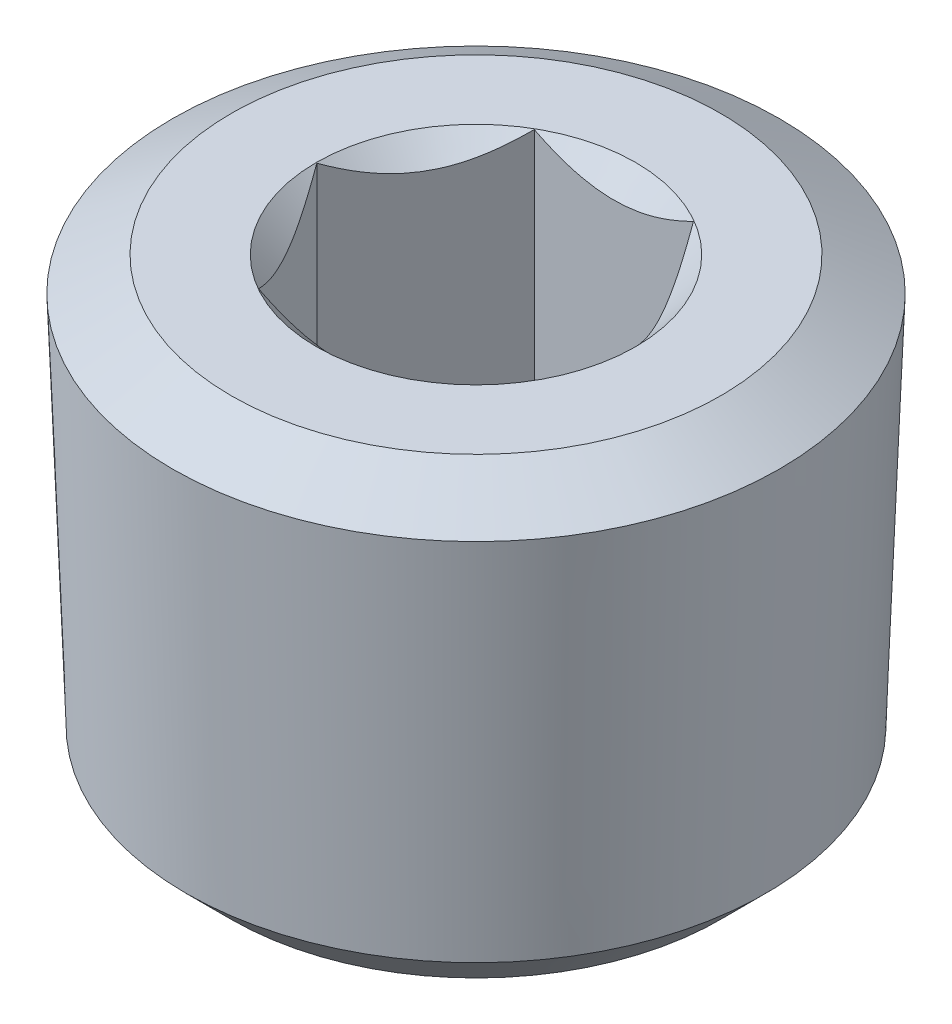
from build123d import *

# Parameters (mm, degrees)
CUT_EXTRUDE1_START = -9.652
CUT_EXTRUDE1_DEPTH = 9.636585


with BuildPart() as part:
    # Sketch2 → Revolve1 (revolve)
    with BuildSketch(Plane.XY, mode=Mode.PRIVATE) as revolve1_sk:
        Polygon((0, 0), (-8.565219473, 0), (-10.624650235, -1.189012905), (-10.146884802, -14.293334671), (-8.565219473, -15.875), (0, -15.875), align=None)
    revolve(revolve1_sk.sketch.rotate(Axis((0, 10.744282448, 0), (0, -1, 0)), 270), axis=Axis((0, 10.744282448, 0), (0, -1, 0)))

    # Sketch3 → Cut-Revolve1 (revolve, cut)
    with BuildSketch(Plane.XY, mode=Mode.PRIVATE) as cut_revolve1_sk:
        Polygon((0, 0), (-5.588, 0), (-4.826, -0.762), (-4.826, -9.652), (-0.598730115, -12.192), (0, -12.192), align=None)
    revolve(cut_revolve1_sk.sketch.rotate(Axis((0, 2.934222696, 0), (0, -1, 0)), 270), axis=Axis((0, 2.934222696, 0), (0, -1, 0)), mode=Mode.SUBTRACT)

    # Sketch4 → Cut-Extrude1 (cut)
    with BuildSketch(Plane(origin=(0, 0, 0), x_dir=(1, 0, 0), z_dir=(0, 1, 0)).offset(CUT_EXTRUDE1_START)):
        Polygon((-2.786292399, -4.826), (2.786292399, -4.826), (5.572584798, 0), (2.786292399, 4.826), (-2.786292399, 4.826), (-5.572584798, 0), align=None)
    extrude(amount=CUT_EXTRUDE1_DEPTH, mode=Mode.SUBTRACT)


solid = part.part
